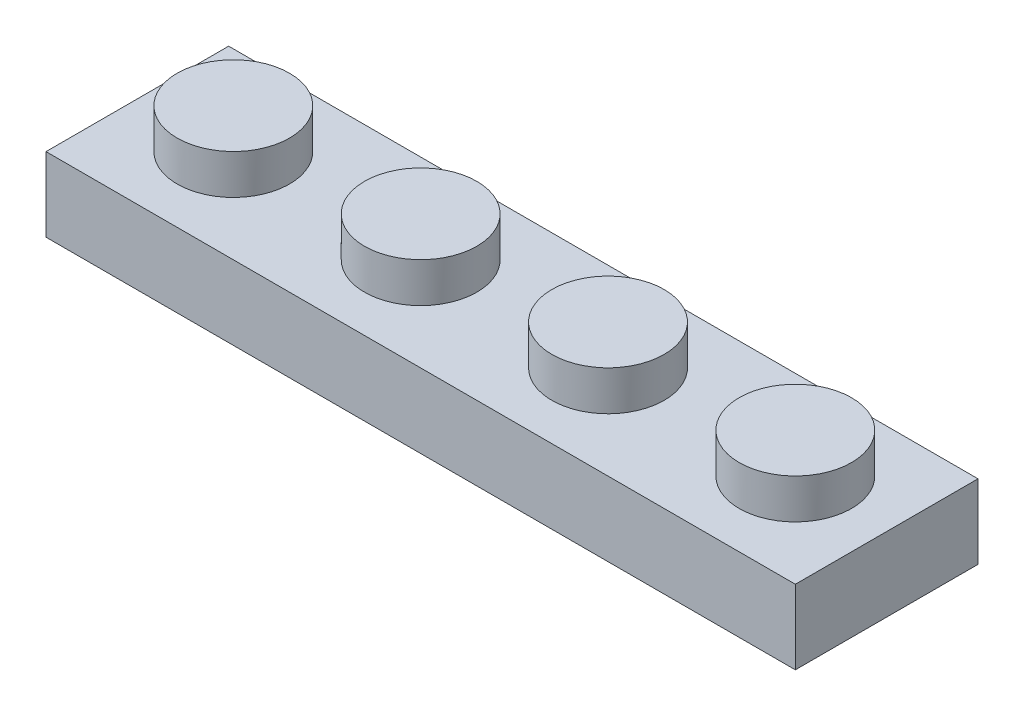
ISO-10303-21;
HEADER;
FILE_DESCRIPTION(('STEP AP214'),'2;1');
FILE_NAME('part.step','',(''),(''),'','','');
FILE_SCHEMA(('AUTOMOTIVE_DESIGN { 1 0 10303 214 1 1 1 1 }'));
ENDSEC;
DATA;
#1=APPLICATION_CONTEXT('core data for automotive mechanical design processes');
#2=APPLICATION_PROTOCOL_DEFINITION('international standard','automotive_design',2000,#1);
#3=PRODUCT_CONTEXT('',#1,'mechanical');
#4=PRODUCT('Part','Part','',(#3));
#5=PRODUCT_RELATED_PRODUCT_CATEGORY('part','',(#4));
#6=PRODUCT_DEFINITION_FORMATION('','',#4);
#7=PRODUCT_DEFINITION_CONTEXT('part definition',#1,'design');
#8=PRODUCT_DEFINITION('design','',#6,#7);
#9=PRODUCT_DEFINITION_SHAPE('','',#8);
#10=(LENGTH_UNIT() NAMED_UNIT(*) SI_UNIT(.MILLI.,.METRE.));
#11=(NAMED_UNIT(*) PLANE_ANGLE_UNIT() SI_UNIT($,.RADIAN.));
#12=(NAMED_UNIT(*) SI_UNIT($,.STERADIAN.) SOLID_ANGLE_UNIT());
#13=UNCERTAINTY_MEASURE_WITH_UNIT(LENGTH_MEASURE(1.E-05),#10,'distance_accuracy_value','');
#14=(GEOMETRIC_REPRESENTATION_CONTEXT(3) GLOBAL_UNCERTAINTY_ASSIGNED_CONTEXT((#13)) GLOBAL_UNIT_ASSIGNED_CONTEXT((#10,
#11,#12)) REPRESENTATION_CONTEXT('',''));
#15=CARTESIAN_POINT('',(0.,0.,0.));
#16=DIRECTION('',(0.,0.,1.));
#17=DIRECTION('',(1.,0.,0.));
#18=AXIS2_PLACEMENT_3D('',#15,#16,#17);
#19=CARTESIAN_POINT('',(0.,3.166,-7.8));
#20=DIRECTION('',(0.,-1.,0.));
#21=DIRECTION('',(0.,0.,-1.));
#22=AXIS2_PLACEMENT_3D('',#19,#20,#21);
#23=PLANE('',#22);
#24=CARTESIAN_POINT('',(20.,3.166,-4.));
#25=DIRECTION('',(0.,-1.,0.));
#26=DIRECTION('',(0.,0.,-1.));
#27=AXIS2_PLACEMENT_3D('',#24,#25,#26);
#28=CIRCLE('',#27,2.4);
#29=CARTESIAN_POINT('',(20.,3.166,-6.4));
#30=VERTEX_POINT('',#29);
#31=EDGE_CURVE('E295',#30,#30,#28,.F.);
#32=ORIENTED_EDGE('',*,*,#31,.F.);
#33=EDGE_LOOP('',(#32));
#34=FACE_BOUND('',#33,.T.);
#35=CARTESIAN_POINT('',(4.,3.166,-4.));
#36=DIRECTION('',(0.,-1.,0.));
#37=DIRECTION('',(0.,0.,-1.));
#38=AXIS2_PLACEMENT_3D('',#35,#36,#37);
#39=CIRCLE('',#38,2.4);
#40=CARTESIAN_POINT('',(4.,3.166,-6.4));
#41=VERTEX_POINT('',#40);
#42=EDGE_CURVE('E289',#41,#41,#39,.F.);
#43=ORIENTED_EDGE('',*,*,#42,.F.);
#44=EDGE_LOOP('',(#43));
#45=FACE_BOUND('',#44,.T.);
#46=DIRECTION('',(0.,0.,1.));
#47=VECTOR('',#46,1.);
#48=CARTESIAN_POINT('',(0.,3.166,0.));
#49=LINE('',#48,#47);
#50=CARTESIAN_POINT('',(0.,3.166,-7.8));
#51=VERTEX_POINT('',#50);
#52=CARTESIAN_POINT('',(0.,3.166,0.));
#53=VERTEX_POINT('',#52);
#54=EDGE_CURVE('E260',#51,#53,#49,.T.);
#55=ORIENTED_EDGE('',*,*,#54,.T.);
#56=DIRECTION('',(1.,0.,0.));
#57=VECTOR('',#56,1.);
#58=CARTESIAN_POINT('',(0.,3.166,0.));
#59=LINE('',#58,#57);
#60=CARTESIAN_POINT('',(32.,3.166,0.));
#61=VERTEX_POINT('',#60);
#62=EDGE_CURVE('E263',#53,#61,#59,.T.);
#63=ORIENTED_EDGE('',*,*,#62,.T.);
#64=DIRECTION('',(0.,0.,-1.));
#65=VECTOR('',#64,1.);
#66=CARTESIAN_POINT('',(32.,3.166,0.));
#67=LINE('',#66,#65);
#68=CARTESIAN_POINT('',(32.,3.166,-7.8));
#69=VERTEX_POINT('',#68);
#70=EDGE_CURVE('E266',#61,#69,#67,.T.);
#71=ORIENTED_EDGE('',*,*,#70,.T.);
#72=DIRECTION('',(-1.,0.,0.));
#73=VECTOR('',#72,1.);
#74=CARTESIAN_POINT('',(0.,3.166,-7.8));
#75=LINE('',#74,#73);
#76=EDGE_CURVE('E268',#69,#51,#75,.T.);
#77=ORIENTED_EDGE('',*,*,#76,.T.);
#78=EDGE_LOOP('',(#55,#63,#71,#77));
#79=FACE_BOUND('',#78,.T.);
#80=CARTESIAN_POINT('',(12.,3.166,-4.));
#81=DIRECTION('',(0.,-1.,0.));
#82=DIRECTION('',(0.,0.,-1.));
#83=AXIS2_PLACEMENT_3D('',#80,#81,#82);
#84=CIRCLE('',#83,2.4);
#85=CARTESIAN_POINT('',(12.,3.166,-6.4));
#86=VERTEX_POINT('',#85);
#87=EDGE_CURVE('E292',#86,#86,#84,.F.);
#88=ORIENTED_EDGE('',*,*,#87,.F.);
#89=EDGE_LOOP('',(#88));
#90=FACE_BOUND('',#89,.T.);
#91=CARTESIAN_POINT('',(28.,3.166,-4.));
#92=DIRECTION('',(0.,-1.,0.));
#93=DIRECTION('',(0.,0.,-1.));
#94=AXIS2_PLACEMENT_3D('',#91,#92,#93);
#95=CIRCLE('',#94,2.4);
#96=CARTESIAN_POINT('',(28.,3.166,-6.4));
#97=VERTEX_POINT('',#96);
#98=EDGE_CURVE('E298',#97,#97,#95,.F.);
#99=ORIENTED_EDGE('',*,*,#98,.F.);
#100=EDGE_LOOP('',(#99));
#101=FACE_BOUND('',#100,.T.);
#102=ADVANCED_FACE('F36',(#34,#45,#79,#90,#101),#23,.F.);
#103=CARTESIAN_POINT('',(0.,3.166,0.));
#104=DIRECTION('',(1.,0.,0.));
#105=DIRECTION('',(0.,0.,-1.));
#106=AXIS2_PLACEMENT_3D('',#103,#104,#105);
#107=PLANE('',#106);
#108=DIRECTION('',(0.,0.,1.));
#109=VECTOR('',#108,1.);
#110=CARTESIAN_POINT('',(0.,0.,0.));
#111=LINE('',#110,#109);
#112=CARTESIAN_POINT('',(0.,0.,-7.8));
#113=VERTEX_POINT('',#112);
#114=CARTESIAN_POINT('',(0.,0.,0.));
#115=VERTEX_POINT('',#114);
#116=EDGE_CURVE('E259',#113,#115,#111,.T.);
#117=ORIENTED_EDGE('',*,*,#116,.T.);
#118=DIRECTION('',(0.,-1.,0.));
#119=VECTOR('',#118,1.);
#120=CARTESIAN_POINT('',(0.,3.166,0.));
#121=LINE('',#120,#119);
#122=EDGE_CURVE('E286',#53,#115,#121,.T.);
#123=ORIENTED_EDGE('',*,*,#122,.F.);
#124=ORIENTED_EDGE('',*,*,#54,.F.);
#125=DIRECTION('',(0.,-1.,0.));
#126=VECTOR('',#125,1.);
#127=CARTESIAN_POINT('',(0.,3.166,-7.8));
#128=LINE('',#127,#126);
#129=EDGE_CURVE('E270',#51,#113,#128,.T.);
#130=ORIENTED_EDGE('',*,*,#129,.T.);
#131=EDGE_LOOP('',(#117,#123,#124,#130));
#132=FACE_BOUND('',#131,.T.);
#133=ADVANCED_FACE('F388',(#132),#107,.F.);
#134=CARTESIAN_POINT('',(0.,3.166,0.));
#135=DIRECTION('',(0.,0.,-1.));
#136=DIRECTION('',(-1.,0.,0.));
#137=AXIS2_PLACEMENT_3D('',#134,#135,#136);
#138=PLANE('',#137);
#139=DIRECTION('',(1.,0.,0.));
#140=VECTOR('',#139,1.);
#141=CARTESIAN_POINT('',(0.,0.,0.));
#142=LINE('',#141,#140);
#143=CARTESIAN_POINT('',(32.,0.,0.));
#144=VERTEX_POINT('',#143);
#145=EDGE_CURVE('E273',#115,#144,#142,.T.);
#146=ORIENTED_EDGE('',*,*,#145,.T.);
#147=DIRECTION('',(0.,-1.,0.));
#148=VECTOR('',#147,1.);
#149=CARTESIAN_POINT('',(32.,3.166,0.));
#150=LINE('',#149,#148);
#151=EDGE_CURVE('E283',#61,#144,#150,.T.);
#152=ORIENTED_EDGE('',*,*,#151,.F.);
#153=ORIENTED_EDGE('',*,*,#62,.F.);
#154=ORIENTED_EDGE('',*,*,#122,.T.);
#155=EDGE_LOOP('',(#146,#152,#153,#154));
#156=FACE_BOUND('',#155,.T.);
#157=ADVANCED_FACE('F393',(#156),#138,.F.);
#158=CARTESIAN_POINT('',(32.,3.166,0.));
#159=DIRECTION('',(-1.,0.,0.));
#160=DIRECTION('',(0.,0.,1.));
#161=AXIS2_PLACEMENT_3D('',#158,#159,#160);
#162=PLANE('',#161);
#163=DIRECTION('',(0.,0.,-1.));
#164=VECTOR('',#163,1.);
#165=CARTESIAN_POINT('',(32.,0.,0.));
#166=LINE('',#165,#164);
#167=CARTESIAN_POINT('',(32.,0.,-7.8));
#168=VERTEX_POINT('',#167);
#169=EDGE_CURVE('E275',#144,#168,#166,.T.);
#170=ORIENTED_EDGE('',*,*,#169,.T.);
#171=DIRECTION('',(0.,-1.,0.));
#172=VECTOR('',#171,1.);
#173=CARTESIAN_POINT('',(32.,3.166,-7.8));
#174=LINE('',#173,#172);
#175=EDGE_CURVE('E280',#69,#168,#174,.T.);
#176=ORIENTED_EDGE('',*,*,#175,.F.);
#177=ORIENTED_EDGE('',*,*,#70,.F.);
#178=ORIENTED_EDGE('',*,*,#151,.T.);
#179=EDGE_LOOP('',(#170,#176,#177,#178));
#180=FACE_BOUND('',#179,.T.);
#181=ADVANCED_FACE('F382',(#180),#162,.F.);
#182=CARTESIAN_POINT('',(0.,3.166,-7.8));
#183=DIRECTION('',(0.,0.,1.));
#184=DIRECTION('',(1.,0.,0.));
#185=AXIS2_PLACEMENT_3D('',#182,#183,#184);
#186=PLANE('',#185);
#187=DIRECTION('',(-1.,0.,0.));
#188=VECTOR('',#187,1.);
#189=CARTESIAN_POINT('',(0.,0.,-7.8));
#190=LINE('',#189,#188);
#191=EDGE_CURVE('E264',#168,#113,#190,.T.);
#192=ORIENTED_EDGE('',*,*,#191,.T.);
#193=ORIENTED_EDGE('',*,*,#129,.F.);
#194=ORIENTED_EDGE('',*,*,#76,.F.);
#195=ORIENTED_EDGE('',*,*,#175,.T.);
#196=EDGE_LOOP('',(#192,#193,#194,#195));
#197=FACE_BOUND('',#196,.T.);
#198=ADVANCED_FACE('F372',(#197),#186,.F.);
#199=CARTESIAN_POINT('',(0.,0.,-7.8));
#200=DIRECTION('',(0.,-1.,0.));
#201=DIRECTION('',(0.,0.,-1.));
#202=AXIS2_PLACEMENT_3D('',#199,#200,#201);
#203=PLANE('',#202);
#204=DIRECTION('',(0.,0.,-1.));
#205=VECTOR('',#204,1.);
#206=CARTESIAN_POINT('',(17.75,0.,-1.55));
#207=LINE('',#206,#205);
#208=CARTESIAN_POINT('',(17.75,0.,-1.55));
#209=VERTEX_POINT('',#208);
#210=CARTESIAN_POINT('',(17.75,0.,-6.35));
#211=VERTEX_POINT('',#210);
#212=EDGE_CURVE('E200',#209,#211,#207,.T.);
#213=ORIENTED_EDGE('',*,*,#212,.F.);
#214=DIRECTION('',(-1.,0.,0.));
#215=VECTOR('',#214,1.);
#216=CARTESIAN_POINT('',(17.75,0.,-1.55));
#217=LINE('',#216,#215);
#218=CARTESIAN_POINT('',(22.55,0.,-1.55));
#219=VERTEX_POINT('',#218);
#220=EDGE_CURVE('E210',#219,#209,#217,.T.);
#221=ORIENTED_EDGE('',*,*,#220,.F.);
#222=DIRECTION('',(0.,0.,1.));
#223=VECTOR('',#222,1.);
#224=CARTESIAN_POINT('',(22.55,0.,-1.55));
#225=LINE('',#224,#223);
#226=CARTESIAN_POINT('',(22.55,0.,-6.35));
#227=VERTEX_POINT('',#226);
#228=EDGE_CURVE('E201',#227,#219,#225,.T.);
#229=ORIENTED_EDGE('',*,*,#228,.F.);
#230=DIRECTION('',(1.,0.,0.));
#231=VECTOR('',#230,1.);
#232=CARTESIAN_POINT('',(17.75,0.,-6.35));
#233=LINE('',#232,#231);
#234=EDGE_CURVE('E186',#211,#227,#233,.T.);
#235=ORIENTED_EDGE('',*,*,#234,.F.);
#236=EDGE_LOOP('',(#213,#221,#229,#235));
#237=FACE_BOUND('',#236,.T.);
#238=DIRECTION('',(0.,0.,-1.));
#239=VECTOR('',#238,1.);
#240=CARTESIAN_POINT('',(25.75,0.,-1.55));
#241=LINE('',#240,#239);
#242=CARTESIAN_POINT('',(25.75,0.,-1.55));
#243=VERTEX_POINT('',#242);
#244=CARTESIAN_POINT('',(25.75,0.,-6.35));
#245=VERTEX_POINT('',#244);
#246=EDGE_CURVE('E224',#243,#245,#241,.T.);
#247=ORIENTED_EDGE('',*,*,#246,.F.);
#248=DIRECTION('',(-1.,0.,0.));
#249=VECTOR('',#248,1.);
#250=CARTESIAN_POINT('',(25.75,0.,-1.55));
#251=LINE('',#250,#249);
#252=CARTESIAN_POINT('',(30.55,0.,-1.55));
#253=VERTEX_POINT('',#252);
#254=EDGE_CURVE('E229',#253,#243,#251,.T.);
#255=ORIENTED_EDGE('',*,*,#254,.F.);
#256=DIRECTION('',(0.,0.,1.));
#257=VECTOR('',#256,1.);
#258=CARTESIAN_POINT('',(30.55,0.,-1.55));
#259=LINE('',#258,#257);
#260=CARTESIAN_POINT('',(30.55,0.,-6.35));
#261=VERTEX_POINT('',#260);
#262=EDGE_CURVE('E243',#261,#253,#259,.T.);
#263=ORIENTED_EDGE('',*,*,#262,.F.);
#264=DIRECTION('',(1.,0.,0.));
#265=VECTOR('',#264,1.);
#266=CARTESIAN_POINT('',(25.75,0.,-6.35));
#267=LINE('',#266,#265);
#268=EDGE_CURVE('E240',#245,#261,#267,.T.);
#269=ORIENTED_EDGE('',*,*,#268,.F.);
#270=EDGE_LOOP('',(#247,#255,#263,#269));
#271=FACE_BOUND('',#270,.T.);
#272=ORIENTED_EDGE('',*,*,#116,.F.);
#273=ORIENTED_EDGE('',*,*,#191,.F.);
#274=ORIENTED_EDGE('',*,*,#169,.F.);
#275=ORIENTED_EDGE('',*,*,#145,.F.);
#276=EDGE_LOOP('',(#272,#273,#274,#275));
#277=FACE_BOUND('',#276,.T.);
#278=DIRECTION('',(0.,0.,-1.));
#279=VECTOR('',#278,1.);
#280=CARTESIAN_POINT('',(9.75,0.,-1.55));
#281=LINE('',#280,#279);
#282=CARTESIAN_POINT('',(9.75,0.,-1.55));
#283=VERTEX_POINT('',#282);
#284=CARTESIAN_POINT('',(9.75,0.,-6.35));
#285=VERTEX_POINT('',#284);
#286=EDGE_CURVE('E301',#283,#285,#281,.T.);
#287=ORIENTED_EDGE('',*,*,#286,.F.);
#288=DIRECTION('',(-1.,0.,0.));
#289=VECTOR('',#288,1.);
#290=CARTESIAN_POINT('',(9.75,0.,-1.55));
#291=LINE('',#290,#289);
#292=CARTESIAN_POINT('',(14.55,0.,-1.55));
#293=VERTEX_POINT('',#292);
#294=EDGE_CURVE('E303',#293,#283,#291,.T.);
#295=ORIENTED_EDGE('',*,*,#294,.F.);
#296=DIRECTION('',(0.,0.,1.));
#297=VECTOR('',#296,1.);
#298=CARTESIAN_POINT('',(14.55,0.,-1.55));
#299=LINE('',#298,#297);
#300=CARTESIAN_POINT('',(14.55,0.,-6.35));
#301=VERTEX_POINT('',#300);
#302=EDGE_CURVE('E306',#301,#293,#299,.T.);
#303=ORIENTED_EDGE('',*,*,#302,.F.);
#304=DIRECTION('',(1.,0.,0.));
#305=VECTOR('',#304,1.);
#306=CARTESIAN_POINT('',(9.75,0.,-6.35));
#307=LINE('',#306,#305);
#308=EDGE_CURVE('E309',#285,#301,#307,.T.);
#309=ORIENTED_EDGE('',*,*,#308,.F.);
#310=EDGE_LOOP('',(#287,#295,#303,#309));
#311=FACE_BOUND('',#310,.T.);
#312=DIRECTION('',(0.,0.,-1.));
#313=VECTOR('',#312,1.);
#314=CARTESIAN_POINT('',(1.75,0.,-1.55));
#315=LINE('',#314,#313);
#316=CARTESIAN_POINT('',(1.75,0.,-1.55));
#317=VERTEX_POINT('',#316);
#318=CARTESIAN_POINT('',(1.75,0.,-6.35));
#319=VERTEX_POINT('',#318);
#320=EDGE_CURVE('E336',#317,#319,#315,.T.);
#321=ORIENTED_EDGE('',*,*,#320,.F.);
#322=DIRECTION('',(-1.,0.,0.));
#323=VECTOR('',#322,1.);
#324=CARTESIAN_POINT('',(1.75,0.,-1.55));
#325=LINE('',#324,#323);
#326=CARTESIAN_POINT('',(6.55,0.,-1.55));
#327=VERTEX_POINT('',#326);
#328=EDGE_CURVE('E338',#327,#317,#325,.T.);
#329=ORIENTED_EDGE('',*,*,#328,.F.);
#330=DIRECTION('',(0.,0.,1.));
#331=VECTOR('',#330,1.);
#332=CARTESIAN_POINT('',(6.55,0.,-1.55));
#333=LINE('',#332,#331);
#334=CARTESIAN_POINT('',(6.55,0.,-6.35));
#335=VERTEX_POINT('',#334);
#336=EDGE_CURVE('E341',#335,#327,#333,.T.);
#337=ORIENTED_EDGE('',*,*,#336,.F.);
#338=DIRECTION('',(1.,0.,0.));
#339=VECTOR('',#338,1.);
#340=CARTESIAN_POINT('',(1.75,0.,-6.35));
#341=LINE('',#340,#339);
#342=EDGE_CURVE('E344',#319,#335,#341,.T.);
#343=ORIENTED_EDGE('',*,*,#342,.F.);
#344=EDGE_LOOP('',(#321,#329,#337,#343));
#345=FACE_BOUND('',#344,.T.);
#346=ADVANCED_FACE('F369',(#237,#271,#277,#311,#345),#203,.T.);
#347=CARTESIAN_POINT('',(4.,4.866,-4.));
#348=DIRECTION('',(0.,-1.,0.));
#349=DIRECTION('',(0.,0.,-1.));
#350=AXIS2_PLACEMENT_3D('',#347,#348,#349);
#351=CYLINDRICAL_SURFACE('',#350,2.4);
#352=CARTESIAN_POINT('',(4.,4.866,-4.));
#353=DIRECTION('',(0.,1.,0.));
#354=DIRECTION('',(0.,0.,1.));
#355=AXIS2_PLACEMENT_3D('',#352,#353,#354);
#356=CIRCLE('',#355,2.4);
#357=CARTESIAN_POINT('',(4.,4.866,-1.6));
#358=VERTEX_POINT('',#357);
#359=EDGE_CURVE('E250',#358,#358,#356,.T.);
#360=ORIENTED_EDGE('',*,*,#359,.F.);
#361=EDGE_LOOP('',(#360));
#362=FACE_BOUND('',#361,.T.);
#363=ORIENTED_EDGE('',*,*,#42,.T.);
#364=EDGE_LOOP('',(#363));
#365=FACE_BOUND('',#364,.T.);
#366=ADVANCED_FACE('F371',(#362,#365),#351,.T.);
#367=CARTESIAN_POINT('',(4.,4.866,-4.));
#368=DIRECTION('',(0.,1.,0.));
#369=DIRECTION('',(0.,0.,1.));
#370=AXIS2_PLACEMENT_3D('',#367,#368,#369);
#371=PLANE('',#370);
#372=ORIENTED_EDGE('',*,*,#359,.T.);
#373=EDGE_LOOP('',(#372));
#374=FACE_BOUND('',#373,.T.);
#375=ADVANCED_FACE('F379',(#374),#371,.T.);
#376=CARTESIAN_POINT('',(25.75,1.75,-1.55));
#377=DIRECTION('',(-1.,0.,0.));
#378=DIRECTION('',(0.,0.,1.));
#379=AXIS2_PLACEMENT_3D('',#376,#377,#378);
#380=PLANE('',#379);
#381=ORIENTED_EDGE('',*,*,#246,.T.);
#382=DIRECTION('',(0.,-1.,0.));
#383=VECTOR('',#382,1.);
#384=CARTESIAN_POINT('',(25.75,1.75,-6.35));
#385=LINE('',#384,#383);
#386=CARTESIAN_POINT('',(25.75,1.75,-6.35));
#387=VERTEX_POINT('',#386);
#388=EDGE_CURVE('E238',#387,#245,#385,.T.);
#389=ORIENTED_EDGE('',*,*,#388,.F.);
#390=DIRECTION('',(0.,0.,-1.));
#391=VECTOR('',#390,1.);
#392=CARTESIAN_POINT('',(25.75,1.75,-1.55));
#393=LINE('',#392,#391);
#394=CARTESIAN_POINT('',(25.75,1.75,-1.55));
#395=VERTEX_POINT('',#394);
#396=EDGE_CURVE('E225',#395,#387,#393,.T.);
#397=ORIENTED_EDGE('',*,*,#396,.F.);
#398=DIRECTION('',(0.,-1.,0.));
#399=VECTOR('',#398,1.);
#400=CARTESIAN_POINT('',(25.75,1.75,-1.55));
#401=LINE('',#400,#399);
#402=EDGE_CURVE('E248',#395,#243,#401,.T.);
#403=ORIENTED_EDGE('',*,*,#402,.T.);
#404=EDGE_LOOP('',(#381,#389,#397,#403));
#405=FACE_BOUND('',#404,.T.);
#406=ADVANCED_FACE('F401',(#405),#380,.F.);
#407=CARTESIAN_POINT('',(25.75,1.75,-1.55));
#408=DIRECTION('',(0.,0.,1.));
#409=DIRECTION('',(1.,0.,0.));
#410=AXIS2_PLACEMENT_3D('',#407,#408,#409);
#411=PLANE('',#410);
#412=ORIENTED_EDGE('',*,*,#254,.T.);
#413=ORIENTED_EDGE('',*,*,#402,.F.);
#414=DIRECTION('',(-1.,0.,0.));
#415=VECTOR('',#414,1.);
#416=CARTESIAN_POINT('',(25.75,1.75,-1.55));
#417=LINE('',#416,#415);
#418=CARTESIAN_POINT('',(30.55,1.75,-1.55));
#419=VERTEX_POINT('',#418);
#420=EDGE_CURVE('E235',#419,#395,#417,.T.);
#421=ORIENTED_EDGE('',*,*,#420,.F.);
#422=DIRECTION('',(0.,-1.,0.));
#423=VECTOR('',#422,1.);
#424=CARTESIAN_POINT('',(30.55,1.75,-1.55));
#425=LINE('',#424,#423);
#426=EDGE_CURVE('E251',#419,#253,#425,.T.);
#427=ORIENTED_EDGE('',*,*,#426,.T.);
#428=EDGE_LOOP('',(#412,#413,#421,#427));
#429=FACE_BOUND('',#428,.T.);
#430=ADVANCED_FACE('F405',(#429),#411,.F.);
#431=CARTESIAN_POINT('',(30.55,1.75,-1.55));
#432=DIRECTION('',(1.,0.,0.));
#433=DIRECTION('',(0.,0.,-1.));
#434=AXIS2_PLACEMENT_3D('',#431,#432,#433);
#435=PLANE('',#434);
#436=ORIENTED_EDGE('',*,*,#262,.T.);
#437=ORIENTED_EDGE('',*,*,#426,.F.);
#438=DIRECTION('',(0.,0.,1.));
#439=VECTOR('',#438,1.);
#440=CARTESIAN_POINT('',(30.55,1.75,-1.55));
#441=LINE('',#440,#439);
#442=CARTESIAN_POINT('',(30.55,1.75,-6.35));
#443=VERTEX_POINT('',#442);
#444=EDGE_CURVE('E232',#443,#419,#441,.T.);
#445=ORIENTED_EDGE('',*,*,#444,.F.);
#446=DIRECTION('',(0.,-1.,0.));
#447=VECTOR('',#446,1.);
#448=CARTESIAN_POINT('',(30.55,1.75,-6.35));
#449=LINE('',#448,#447);
#450=EDGE_CURVE('E253',#443,#261,#449,.T.);
#451=ORIENTED_EDGE('',*,*,#450,.T.);
#452=EDGE_LOOP('',(#436,#437,#445,#451));
#453=FACE_BOUND('',#452,.T.);
#454=ADVANCED_FACE('F411',(#453),#435,.F.);
#455=CARTESIAN_POINT('',(25.75,1.75,-6.35));
#456=DIRECTION('',(0.,0.,-1.));
#457=DIRECTION('',(-1.,0.,0.));
#458=AXIS2_PLACEMENT_3D('',#455,#456,#457);
#459=PLANE('',#458);
#460=ORIENTED_EDGE('',*,*,#268,.T.);
#461=ORIENTED_EDGE('',*,*,#450,.F.);
#462=DIRECTION('',(1.,0.,0.));
#463=VECTOR('',#462,1.);
#464=CARTESIAN_POINT('',(25.75,1.75,-6.35));
#465=LINE('',#464,#463);
#466=EDGE_CURVE('E228',#387,#443,#465,.T.);
#467=ORIENTED_EDGE('',*,*,#466,.F.);
#468=ORIENTED_EDGE('',*,*,#388,.T.);
#469=EDGE_LOOP('',(#460,#461,#467,#468));
#470=FACE_BOUND('',#469,.T.);
#471=ADVANCED_FACE('F407',(#470),#459,.F.);
#472=CARTESIAN_POINT('',(25.75,1.75,-6.35));
#473=DIRECTION('',(0.,-1.,0.));
#474=DIRECTION('',(0.,0.,-1.));
#475=AXIS2_PLACEMENT_3D('',#472,#473,#474);
#476=PLANE('',#475);
#477=ORIENTED_EDGE('',*,*,#396,.T.);
#478=ORIENTED_EDGE('',*,*,#466,.T.);
#479=ORIENTED_EDGE('',*,*,#444,.T.);
#480=ORIENTED_EDGE('',*,*,#420,.T.);
#481=EDGE_LOOP('',(#477,#478,#479,#480));
#482=FACE_BOUND('',#481,.T.);
#483=ADVANCED_FACE('F410',(#482),#476,.T.);
#484=CARTESIAN_POINT('',(12.,4.866,-4.));
#485=DIRECTION('',(0.,-1.,0.));
#486=DIRECTION('',(0.,0.,-1.));
#487=AXIS2_PLACEMENT_3D('',#484,#485,#486);
#488=CYLINDRICAL_SURFACE('',#487,2.4);
#489=CARTESIAN_POINT('',(12.,4.866,-4.));
#490=DIRECTION('',(0.,1.,0.));
#491=DIRECTION('',(0.,0.,1.));
#492=AXIS2_PLACEMENT_3D('',#489,#490,#491);
#493=CIRCLE('',#492,2.4);
#494=CARTESIAN_POINT('',(12.,4.866,-1.6));
#495=VERTEX_POINT('',#494);
#496=EDGE_CURVE('E221',#495,#495,#493,.T.);
#497=ORIENTED_EDGE('',*,*,#496,.F.);
#498=EDGE_LOOP('',(#497));
#499=FACE_BOUND('',#498,.T.);
#500=ORIENTED_EDGE('',*,*,#87,.T.);
#501=EDGE_LOOP('',(#500));
#502=FACE_BOUND('',#501,.T.);
#503=ADVANCED_FACE('F421',(#499,#502),#488,.T.);
#504=CARTESIAN_POINT('',(12.,4.866,-4.));
#505=DIRECTION('',(0.,1.,0.));
#506=DIRECTION('',(0.,0.,1.));
#507=AXIS2_PLACEMENT_3D('',#504,#505,#506);
#508=PLANE('',#507);
#509=ORIENTED_EDGE('',*,*,#496,.T.);
#510=EDGE_LOOP('',(#509));
#511=FACE_BOUND('',#510,.T.);
#512=ADVANCED_FACE('F423',(#511),#508,.T.);
#513=CARTESIAN_POINT('',(20.,4.866,-4.));
#514=DIRECTION('',(0.,-1.,0.));
#515=DIRECTION('',(0.,0.,-1.));
#516=AXIS2_PLACEMENT_3D('',#513,#514,#515);
#517=CYLINDRICAL_SURFACE('',#516,2.4);
#518=CARTESIAN_POINT('',(20.,4.866,-4.));
#519=DIRECTION('',(0.,1.,0.));
#520=DIRECTION('',(0.,0.,1.));
#521=AXIS2_PLACEMENT_3D('',#518,#519,#520);
#522=CIRCLE('',#521,2.4);
#523=CARTESIAN_POINT('',(20.,4.866,-1.6));
#524=VERTEX_POINT('',#523);
#525=EDGE_CURVE('E218',#524,#524,#522,.T.);
#526=ORIENTED_EDGE('',*,*,#525,.F.);
#527=EDGE_LOOP('',(#526));
#528=FACE_BOUND('',#527,.T.);
#529=ORIENTED_EDGE('',*,*,#31,.T.);
#530=EDGE_LOOP('',(#529));
#531=FACE_BOUND('',#530,.T.);
#532=ADVANCED_FACE('F430',(#528,#531),#517,.T.);
#533=CARTESIAN_POINT('',(20.,4.866,-4.));
#534=DIRECTION('',(0.,1.,0.));
#535=DIRECTION('',(0.,0.,1.));
#536=AXIS2_PLACEMENT_3D('',#533,#534,#535);
#537=PLANE('',#536);
#538=ORIENTED_EDGE('',*,*,#525,.T.);
#539=EDGE_LOOP('',(#538));
#540=FACE_BOUND('',#539,.T.);
#541=ADVANCED_FACE('F427',(#540),#537,.T.);
#542=CARTESIAN_POINT('',(28.,4.866,-4.));
#543=DIRECTION('',(0.,-1.,0.));
#544=DIRECTION('',(0.,0.,-1.));
#545=AXIS2_PLACEMENT_3D('',#542,#543,#544);
#546=CYLINDRICAL_SURFACE('',#545,2.4);
#547=CARTESIAN_POINT('',(28.,4.866,-4.));
#548=DIRECTION('',(0.,1.,0.));
#549=DIRECTION('',(0.,0.,1.));
#550=AXIS2_PLACEMENT_3D('',#547,#548,#549);
#551=CIRCLE('',#550,2.4);
#552=CARTESIAN_POINT('',(28.,4.866,-1.6));
#553=VERTEX_POINT('',#552);
#554=EDGE_CURVE('E215',#553,#553,#551,.T.);
#555=ORIENTED_EDGE('',*,*,#554,.F.);
#556=EDGE_LOOP('',(#555));
#557=FACE_BOUND('',#556,.T.);
#558=ORIENTED_EDGE('',*,*,#98,.T.);
#559=EDGE_LOOP('',(#558));
#560=FACE_BOUND('',#559,.T.);
#561=ADVANCED_FACE('F438',(#557,#560),#546,.T.);
#562=CARTESIAN_POINT('',(28.,4.866,-4.));
#563=DIRECTION('',(0.,1.,0.));
#564=DIRECTION('',(0.,0.,1.));
#565=AXIS2_PLACEMENT_3D('',#562,#563,#564);
#566=PLANE('',#565);
#567=ORIENTED_EDGE('',*,*,#554,.T.);
#568=EDGE_LOOP('',(#567));
#569=FACE_BOUND('',#568,.T.);
#570=ADVANCED_FACE('F435',(#569),#566,.T.);
#571=CARTESIAN_POINT('',(17.75,1.75,-1.55));
#572=DIRECTION('',(-1.,0.,0.));
#573=DIRECTION('',(0.,0.,1.));
#574=AXIS2_PLACEMENT_3D('',#571,#572,#573);
#575=PLANE('',#574);
#576=ORIENTED_EDGE('',*,*,#212,.T.);
#577=DIRECTION('',(0.,-1.,0.));
#578=VECTOR('',#577,1.);
#579=CARTESIAN_POINT('',(17.75,1.75,-6.35));
#580=LINE('',#579,#578);
#581=CARTESIAN_POINT('',(17.75,1.75,-6.35));
#582=VERTEX_POINT('',#581);
#583=EDGE_CURVE('E192',#582,#211,#580,.T.);
#584=ORIENTED_EDGE('',*,*,#583,.F.);
#585=DIRECTION('',(0.,0.,-1.));
#586=VECTOR('',#585,1.);
#587=CARTESIAN_POINT('',(17.75,1.75,-1.55));
#588=LINE('',#587,#586);
#589=CARTESIAN_POINT('',(17.75,1.75,-1.55));
#590=VERTEX_POINT('',#589);
#591=EDGE_CURVE('E175',#590,#582,#588,.T.);
#592=ORIENTED_EDGE('',*,*,#591,.F.);
#593=DIRECTION('',(0.,-1.,0.));
#594=VECTOR('',#593,1.);
#595=CARTESIAN_POINT('',(17.75,1.75,-1.55));
#596=LINE('',#595,#594);
#597=EDGE_CURVE('E212',#590,#209,#596,.T.);
#598=ORIENTED_EDGE('',*,*,#597,.T.);
#599=EDGE_LOOP('',(#576,#584,#592,#598));
#600=FACE_BOUND('',#599,.T.);
#601=ADVANCED_FACE('F198',(#600),#575,.F.);
#602=CARTESIAN_POINT('',(17.75,1.75,-1.55));
#603=DIRECTION('',(0.,0.,1.));
#604=DIRECTION('',(1.,0.,0.));
#605=AXIS2_PLACEMENT_3D('',#602,#603,#604);
#606=PLANE('',#605);
#607=ORIENTED_EDGE('',*,*,#220,.T.);
#608=ORIENTED_EDGE('',*,*,#597,.F.);
#609=DIRECTION('',(-1.,0.,0.));
#610=VECTOR('',#609,1.);
#611=CARTESIAN_POINT('',(17.75,1.75,-1.55));
#612=LINE('',#611,#610);
#613=CARTESIAN_POINT('',(22.55,1.75,-1.55));
#614=VERTEX_POINT('',#613);
#615=EDGE_CURVE('E181',#614,#590,#612,.T.);
#616=ORIENTED_EDGE('',*,*,#615,.F.);
#617=DIRECTION('',(0.,-1.,0.));
#618=VECTOR('',#617,1.);
#619=CARTESIAN_POINT('',(22.55,1.75,-1.55));
#620=LINE('',#619,#618);
#621=EDGE_CURVE('E203',#614,#219,#620,.T.);
#622=ORIENTED_EDGE('',*,*,#621,.T.);
#623=EDGE_LOOP('',(#607,#608,#616,#622));
#624=FACE_BOUND('',#623,.T.);
#625=ADVANCED_FACE('F448',(#624),#606,.F.);
#626=CARTESIAN_POINT('',(22.55,1.75,-1.55));
#627=DIRECTION('',(1.,0.,0.));
#628=DIRECTION('',(0.,0.,-1.));
#629=AXIS2_PLACEMENT_3D('',#626,#627,#628);
#630=PLANE('',#629);
#631=ORIENTED_EDGE('',*,*,#228,.T.);
#632=ORIENTED_EDGE('',*,*,#621,.F.);
#633=DIRECTION('',(0.,0.,1.));
#634=VECTOR('',#633,1.);
#635=CARTESIAN_POINT('',(22.55,1.75,-1.55));
#636=LINE('',#635,#634);
#637=CARTESIAN_POINT('',(22.55,1.75,-6.35));
#638=VERTEX_POINT('',#637);
#639=EDGE_CURVE('E196',#638,#614,#636,.T.);
#640=ORIENTED_EDGE('',*,*,#639,.F.);
#641=DIRECTION('',(0.,-1.,0.));
#642=VECTOR('',#641,1.);
#643=CARTESIAN_POINT('',(22.55,1.75,-6.35));
#644=LINE('',#643,#642);
#645=EDGE_CURVE('E195',#638,#227,#644,.T.);
#646=ORIENTED_EDGE('',*,*,#645,.T.);
#647=EDGE_LOOP('',(#631,#632,#640,#646));
#648=FACE_BOUND('',#647,.T.);
#649=ADVANCED_FACE('F452',(#648),#630,.F.);
#650=CARTESIAN_POINT('',(17.75,1.75,-6.35));
#651=DIRECTION('',(0.,0.,-1.));
#652=DIRECTION('',(-1.,0.,0.));
#653=AXIS2_PLACEMENT_3D('',#650,#651,#652);
#654=PLANE('',#653);
#655=ORIENTED_EDGE('',*,*,#234,.T.);
#656=ORIENTED_EDGE('',*,*,#645,.F.);
#657=DIRECTION('',(1.,0.,0.));
#658=VECTOR('',#657,1.);
#659=CARTESIAN_POINT('',(17.75,1.75,-6.35));
#660=LINE('',#659,#658);
#661=EDGE_CURVE('E178',#582,#638,#660,.T.);
#662=ORIENTED_EDGE('',*,*,#661,.F.);
#663=ORIENTED_EDGE('',*,*,#583,.T.);
#664=EDGE_LOOP('',(#655,#656,#662,#663));
#665=FACE_BOUND('',#664,.T.);
#666=ADVANCED_FACE('F191',(#665),#654,.F.);
#667=CARTESIAN_POINT('',(17.75,1.75,-6.35));
#668=DIRECTION('',(0.,-1.,0.));
#669=DIRECTION('',(0.,0.,-1.));
#670=AXIS2_PLACEMENT_3D('',#667,#668,#669);
#671=PLANE('',#670);
#672=ORIENTED_EDGE('',*,*,#591,.T.);
#673=ORIENTED_EDGE('',*,*,#661,.T.);
#674=ORIENTED_EDGE('',*,*,#639,.T.);
#675=ORIENTED_EDGE('',*,*,#615,.T.);
#676=EDGE_LOOP('',(#672,#673,#674,#675));
#677=FACE_BOUND('',#676,.T.);
#678=ADVANCED_FACE('F177',(#677),#671,.T.);
#679=CARTESIAN_POINT('',(9.75,1.75,-6.35));
#680=DIRECTION('',(0.,-1.,0.));
#681=DIRECTION('',(0.,0.,-1.));
#682=AXIS2_PLACEMENT_3D('',#679,#680,#681);
#683=PLANE('',#682);
#684=DIRECTION('',(0.,0.,-1.));
#685=VECTOR('',#684,1.);
#686=CARTESIAN_POINT('',(9.75,1.75,-1.55));
#687=LINE('',#686,#685);
#688=CARTESIAN_POINT('',(9.75,1.75,-1.55));
#689=VERTEX_POINT('',#688);
#690=CARTESIAN_POINT('',(9.75,1.75,-6.35));
#691=VERTEX_POINT('',#690);
#692=EDGE_CURVE('E315',#689,#691,#687,.T.);
#693=ORIENTED_EDGE('',*,*,#692,.T.);
#694=DIRECTION('',(1.,0.,0.));
#695=VECTOR('',#694,1.);
#696=CARTESIAN_POINT('',(9.75,1.75,-6.35));
#697=LINE('',#696,#695);
#698=CARTESIAN_POINT('',(14.55,1.75,-6.35));
#699=VERTEX_POINT('',#698);
#700=EDGE_CURVE('E333',#691,#699,#697,.T.);
#701=ORIENTED_EDGE('',*,*,#700,.T.);
#702=DIRECTION('',(0.,0.,1.));
#703=VECTOR('',#702,1.);
#704=CARTESIAN_POINT('',(14.55,1.75,-1.55));
#705=LINE('',#704,#703);
#706=CARTESIAN_POINT('',(14.55,1.75,-1.55));
#707=VERTEX_POINT('',#706);
#708=EDGE_CURVE('E327',#699,#707,#705,.T.);
#709=ORIENTED_EDGE('',*,*,#708,.T.);
#710=DIRECTION('',(-1.,0.,0.));
#711=VECTOR('',#710,1.);
#712=CARTESIAN_POINT('',(9.75,1.75,-1.55));
#713=LINE('',#712,#711);
#714=EDGE_CURVE('E321',#707,#689,#713,.T.);
#715=ORIENTED_EDGE('',*,*,#714,.T.);
#716=EDGE_LOOP('',(#693,#701,#709,#715));
#717=FACE_BOUND('',#716,.T.);
#718=ADVANCED_FACE('F449',(#717),#683,.T.);
#719=CARTESIAN_POINT('',(9.75,1.75,-6.35));
#720=DIRECTION('',(0.,0.,-1.));
#721=DIRECTION('',(-1.,0.,0.));
#722=AXIS2_PLACEMENT_3D('',#719,#720,#721);
#723=PLANE('',#722);
#724=ORIENTED_EDGE('',*,*,#308,.T.);
#725=DIRECTION('',(0.,-1.,0.));
#726=VECTOR('',#725,1.);
#727=CARTESIAN_POINT('',(14.55,1.75,-6.35));
#728=LINE('',#727,#726);
#729=EDGE_CURVE('E330',#699,#301,#728,.T.);
#730=ORIENTED_EDGE('',*,*,#729,.F.);
#731=ORIENTED_EDGE('',*,*,#700,.F.);
#732=DIRECTION('',(0.,-1.,0.));
#733=VECTOR('',#732,1.);
#734=CARTESIAN_POINT('',(9.75,1.75,-6.35));
#735=LINE('',#734,#733);
#736=EDGE_CURVE('E312',#691,#285,#735,.T.);
#737=ORIENTED_EDGE('',*,*,#736,.T.);
#738=EDGE_LOOP('',(#724,#730,#731,#737));
#739=FACE_BOUND('',#738,.T.);
#740=ADVANCED_FACE('F463',(#739),#723,.F.);
#741=CARTESIAN_POINT('',(14.55,1.75,-1.55));
#742=DIRECTION('',(1.,0.,0.));
#743=DIRECTION('',(0.,0.,-1.));
#744=AXIS2_PLACEMENT_3D('',#741,#742,#743);
#745=PLANE('',#744);
#746=ORIENTED_EDGE('',*,*,#302,.T.);
#747=DIRECTION('',(0.,-1.,0.));
#748=VECTOR('',#747,1.);
#749=CARTESIAN_POINT('',(14.55,1.75,-1.55));
#750=LINE('',#749,#748);
#751=EDGE_CURVE('E324',#707,#293,#750,.T.);
#752=ORIENTED_EDGE('',*,*,#751,.F.);
#753=ORIENTED_EDGE('',*,*,#708,.F.);
#754=ORIENTED_EDGE('',*,*,#729,.T.);
#755=EDGE_LOOP('',(#746,#752,#753,#754));
#756=FACE_BOUND('',#755,.T.);
#757=ADVANCED_FACE('F469',(#756),#745,.F.);
#758=CARTESIAN_POINT('',(9.75,1.75,-1.55));
#759=DIRECTION('',(0.,0.,1.));
#760=DIRECTION('',(1.,0.,0.));
#761=AXIS2_PLACEMENT_3D('',#758,#759,#760);
#762=PLANE('',#761);
#763=ORIENTED_EDGE('',*,*,#294,.T.);
#764=DIRECTION('',(0.,-1.,0.));
#765=VECTOR('',#764,1.);
#766=CARTESIAN_POINT('',(9.75,1.75,-1.55));
#767=LINE('',#766,#765);
#768=EDGE_CURVE('E318',#689,#283,#767,.T.);
#769=ORIENTED_EDGE('',*,*,#768,.F.);
#770=ORIENTED_EDGE('',*,*,#714,.F.);
#771=ORIENTED_EDGE('',*,*,#751,.T.);
#772=EDGE_LOOP('',(#763,#769,#770,#771));
#773=FACE_BOUND('',#772,.T.);
#774=ADVANCED_FACE('F487',(#773),#762,.F.);
#775=CARTESIAN_POINT('',(9.75,1.75,-1.55));
#776=DIRECTION('',(-1.,0.,0.));
#777=DIRECTION('',(0.,0.,1.));
#778=AXIS2_PLACEMENT_3D('',#775,#776,#777);
#779=PLANE('',#778);
#780=ORIENTED_EDGE('',*,*,#286,.T.);
#781=ORIENTED_EDGE('',*,*,#736,.F.);
#782=ORIENTED_EDGE('',*,*,#692,.F.);
#783=ORIENTED_EDGE('',*,*,#768,.T.);
#784=EDGE_LOOP('',(#780,#781,#782,#783));
#785=FACE_BOUND('',#784,.T.);
#786=ADVANCED_FACE('F483',(#785),#779,.F.);
#787=CARTESIAN_POINT('',(1.75,1.75,-6.35));
#788=DIRECTION('',(0.,-1.,0.));
#789=DIRECTION('',(0.,0.,-1.));
#790=AXIS2_PLACEMENT_3D('',#787,#788,#789);
#791=PLANE('',#790);
#792=DIRECTION('',(0.,0.,-1.));
#793=VECTOR('',#792,1.);
#794=CARTESIAN_POINT('',(1.75,1.75,-1.55));
#795=LINE('',#794,#793);
#796=CARTESIAN_POINT('',(1.75,1.75,-1.55));
#797=VERTEX_POINT('',#796);
#798=CARTESIAN_POINT('',(1.75,1.75,-6.35));
#799=VERTEX_POINT('',#798);
#800=EDGE_CURVE('E350',#797,#799,#795,.T.);
#801=ORIENTED_EDGE('',*,*,#800,.T.);
#802=DIRECTION('',(1.,0.,0.));
#803=VECTOR('',#802,1.);
#804=CARTESIAN_POINT('',(1.75,1.75,-6.35));
#805=LINE('',#804,#803);
#806=CARTESIAN_POINT('',(6.55,1.75,-6.35));
#807=VERTEX_POINT('',#806);
#808=EDGE_CURVE('E11',#799,#807,#805,.T.);
#809=ORIENTED_EDGE('',*,*,#808,.T.);
#810=DIRECTION('',(0.,0.,1.));
#811=VECTOR('',#810,1.);
#812=CARTESIAN_POINT('',(6.55,1.75,-1.55));
#813=LINE('',#812,#811);
#814=CARTESIAN_POINT('',(6.55,1.75,-1.55));
#815=VERTEX_POINT('',#814);
#816=EDGE_CURVE('E51',#807,#815,#813,.T.);
#817=ORIENTED_EDGE('',*,*,#816,.T.);
#818=DIRECTION('',(-1.,0.,0.));
#819=VECTOR('',#818,1.);
#820=CARTESIAN_POINT('',(1.75,1.75,-1.55));
#821=LINE('',#820,#819);
#822=EDGE_CURVE('E59',#815,#797,#821,.T.);
#823=ORIENTED_EDGE('',*,*,#822,.T.);
#824=EDGE_LOOP('',(#801,#809,#817,#823));
#825=FACE_BOUND('',#824,.T.);
#826=ADVANCED_FACE('F38',(#825),#791,.T.);
#827=CARTESIAN_POINT('',(1.75,1.75,-6.35));
#828=DIRECTION('',(0.,0.,-1.));
#829=DIRECTION('',(-1.,0.,0.));
#830=AXIS2_PLACEMENT_3D('',#827,#828,#829);
#831=PLANE('',#830);
#832=ORIENTED_EDGE('',*,*,#342,.T.);
#833=DIRECTION('',(0.,-1.,0.));
#834=VECTOR('',#833,1.);
#835=CARTESIAN_POINT('',(6.55,1.75,-6.35));
#836=LINE('',#835,#834);
#837=EDGE_CURVE('E44',#807,#335,#836,.T.);
#838=ORIENTED_EDGE('',*,*,#837,.F.);
#839=ORIENTED_EDGE('',*,*,#808,.F.);
#840=DIRECTION('',(0.,-1.,0.));
#841=VECTOR('',#840,1.);
#842=CARTESIAN_POINT('',(1.75,1.75,-6.35));
#843=LINE('',#842,#841);
#844=EDGE_CURVE('E347',#799,#319,#843,.T.);
#845=ORIENTED_EDGE('',*,*,#844,.T.);
#846=EDGE_LOOP('',(#832,#838,#839,#845));
#847=FACE_BOUND('',#846,.T.);
#848=ADVANCED_FACE('F362',(#847),#831,.F.);
#849=CARTESIAN_POINT('',(6.55,1.75,-1.55));
#850=DIRECTION('',(1.,0.,0.));
#851=DIRECTION('',(0.,0.,-1.));
#852=AXIS2_PLACEMENT_3D('',#849,#850,#851);
#853=PLANE('',#852);
#854=ORIENTED_EDGE('',*,*,#336,.T.);
#855=DIRECTION('',(0.,-1.,0.));
#856=VECTOR('',#855,1.);
#857=CARTESIAN_POINT('',(6.55,1.75,-1.55));
#858=LINE('',#857,#856);
#859=EDGE_CURVE('E357',#815,#327,#858,.T.);
#860=ORIENTED_EDGE('',*,*,#859,.F.);
#861=ORIENTED_EDGE('',*,*,#816,.F.);
#862=ORIENTED_EDGE('',*,*,#837,.T.);
#863=EDGE_LOOP('',(#854,#860,#861,#862));
#864=FACE_BOUND('',#863,.T.);
#865=ADVANCED_FACE('F359',(#864),#853,.F.);
#866=CARTESIAN_POINT('',(1.75,1.75,-1.55));
#867=DIRECTION('',(0.,0.,1.));
#868=DIRECTION('',(1.,0.,0.));
#869=AXIS2_PLACEMENT_3D('',#866,#867,#868);
#870=PLANE('',#869);
#871=ORIENTED_EDGE('',*,*,#328,.T.);
#872=DIRECTION('',(0.,-1.,0.));
#873=VECTOR('',#872,1.);
#874=CARTESIAN_POINT('',(1.75,1.75,-1.55));
#875=LINE('',#874,#873);
#876=EDGE_CURVE('E353',#797,#317,#875,.T.);
#877=ORIENTED_EDGE('',*,*,#876,.F.);
#878=ORIENTED_EDGE('',*,*,#822,.F.);
#879=ORIENTED_EDGE('',*,*,#859,.T.);
#880=EDGE_LOOP('',(#871,#877,#878,#879));
#881=FACE_BOUND('',#880,.T.);
#882=ADVANCED_FACE('F367',(#881),#870,.F.);
#883=CARTESIAN_POINT('',(1.75,1.75,-1.55));
#884=DIRECTION('',(-1.,0.,0.));
#885=DIRECTION('',(0.,0.,1.));
#886=AXIS2_PLACEMENT_3D('',#883,#884,#885);
#887=PLANE('',#886);
#888=ORIENTED_EDGE('',*,*,#320,.T.);
#889=ORIENTED_EDGE('',*,*,#844,.F.);
#890=ORIENTED_EDGE('',*,*,#800,.F.);
#891=ORIENTED_EDGE('',*,*,#876,.T.);
#892=EDGE_LOOP('',(#888,#889,#890,#891));
#893=FACE_BOUND('',#892,.T.);
#894=ADVANCED_FACE('F366',(#893),#887,.F.);
#895=CLOSED_SHELL('',(#102,#133,#157,#181,#198,#346,#366,#375,#406,#430,#454,#471,#483,#503,
#512,#532,#541,#561,#570,#601,#625,#649,#666,#678,#718,#740,#757,#774,#786,#826,#848,#865,#882,#894));
#896=MANIFOLD_SOLID_BREP('B2',#895);
#897=ADVANCED_BREP_SHAPE_REPRESENTATION('',(#18,#896),#14);
#898=SHAPE_DEFINITION_REPRESENTATION(#9,#897);
ENDSEC;
END-ISO-10303-21;
